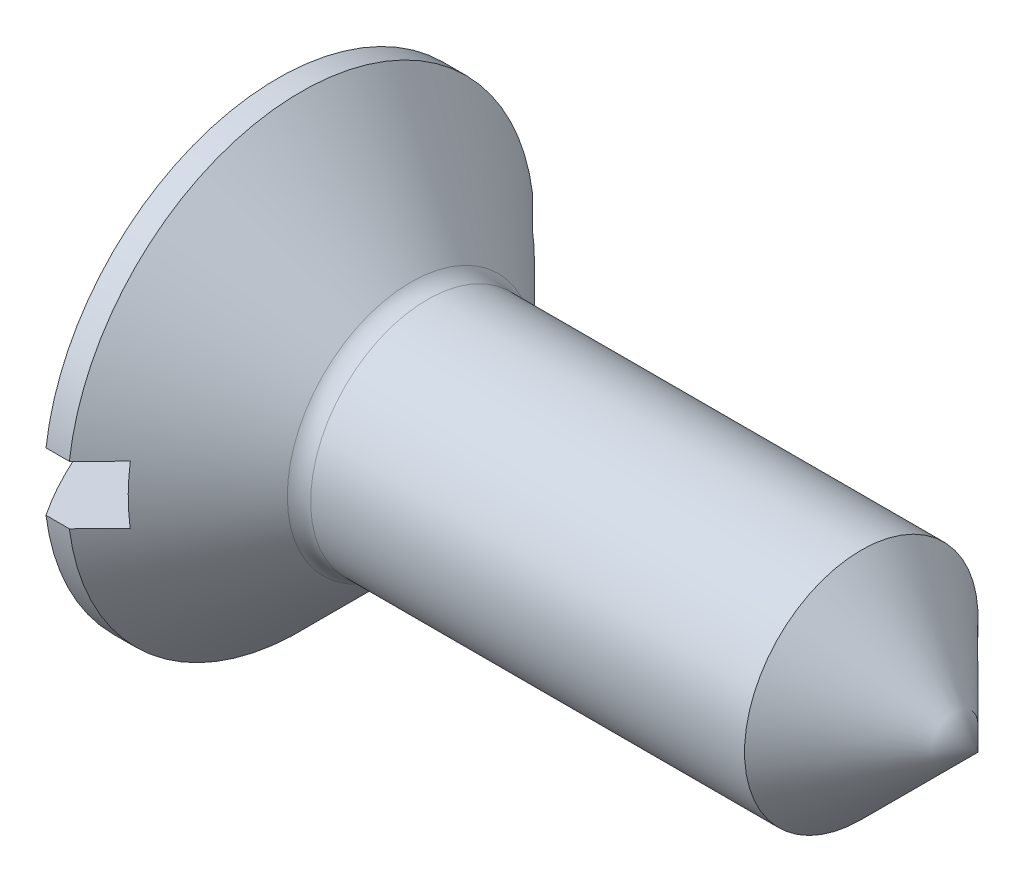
from build123d import *

# Parameters (mm, degrees)
SKETCH1_R          = 1
BASEBODY_DEPTH     = 4.8
SKETCH3_R          = 2.2
SKETCH3_R_2        = 2
CUT_EXTRUDE1_DEPTH = 7.758698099
SLOT_DEPTH         = 7.017224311
SLOT_DEPTH_BACK    = 7.017224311
SKETCH5_W          = 0.5
SKETCH5_H          = 1.06
FILLET1_R          = 0.2


with BuildPart() as part:
    # Sketch2 → BaseHead (revolve)
    with BuildSketch(Plane(origin=(1.691547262, 0, 0.508452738), x_dir=(0, 0, -1), z_dir=(0, 1, 0))):
        Polygon((0.508452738, 0.491547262), (1.508452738, 0.491547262), (2.708452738, 1.691547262), (0.508452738, 1.691547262), align=None)
    revolve(axis=Axis((6, 0, 0), (-1, 0, 0)))

    # Sketch1 → BaseBody (add)
    with BuildSketch(Plane(origin=(1.2, 0.243512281, -0.448198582), x_dir=(0, 0, -1), z_dir=(1, 0, 0))):
        with Locations((-0.448198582, -0.243512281)):
            Circle(SKETCH1_R)
    extrude(amount=BASEBODY_DEPTH)

    # Sketch3 → Cut-Extrude1 (cut, through all)
    with BuildSketch(Plane(origin=(0, 0, 0), x_dir=(0, 0, -1), z_dir=(1, 0, 0))):
        Circle(SKETCH3_R)
        with Locations(Location((0, 0, 0), (0, 0, 180))):
            Circle(SKETCH3_R_2, mode=Mode.SUBTRACT)
    extrude(amount=CUT_EXTRUDE1_DEPTH, mode=Mode.SUBTRACT)

    # Sketch4 → BaseTop (revolve)
    with BuildSketch(Plane(origin=(2.485835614, 0, -0.485835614), x_dir=(0, 0, -1), z_dir=(0, 1, 0))):
        with BuildLine():
            Line((-0.235835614, 3.085835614), (-0.235835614, 2.485835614))
            Line((-0.235835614, 2.485835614), (1.514164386, 2.485835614))
            ThreePointArc((1.514164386, 2.485835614), (0.678364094, 2.900168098), (-0.235835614, 3.085835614))
        make_face()
    revolve(axis=Axis((2.485835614, 0, 0), (-1, 0, 0)))

    # Sketch5 → Slot (cut, two sides: drawn at the far end of the back side and taken through both)
    with BuildSketch(Plane(origin=(1.678295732, 1.678295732, 0), x_dir=(0, 1, 0), z_dir=(0, 0, 1)).offset(-SLOT_DEPTH_BACK)):
        with Locations((-1.678295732, 1.748295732)):
            Rectangle(SKETCH5_W, SKETCH5_H)
    extrude(amount=SLOT_DEPTH + SLOT_DEPTH_BACK, mode=Mode.SUBTRACT)

    # Fillet1
    fillet1_edges = [part.edges().sort_by_distance(p)[0] for p in [
        (1.2, 0, 1),
    ]]
    fillet(fillet1_edges, radius=FILLET1_R)

    # Sketch6 → Cut-Revolve1 (revolve, cut)
    with BuildSketch(Plane(origin=(12.798369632, -7.201630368, 0), x_dir=(0, 1, 0), z_dir=(0, 0, 1)), mode=Mode.PRIVATE) as cut_revolve1_sk:
        Polygon((7.201630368, 6.053668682), (27.201630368, 6.053668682), (27.201630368, 26.798369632), (7.201630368, 6.798369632), align=None)
    revolve(cut_revolve1_sk.sketch.rotate(Axis((16.635932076, 0, 0), (1, 0, 0)), 180), axis=Axis((16.635932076, 0, 0), (1, 0, 0)), mode=Mode.SUBTRACT)


solid = part.part
